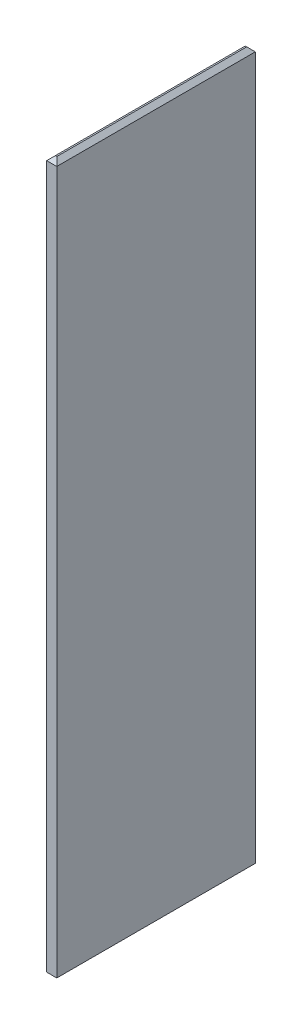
ISO-10303-21;
HEADER;
FILE_DESCRIPTION(('STEP AP214'),'2;1');
FILE_NAME('part.step','',(''),(''),'','','');
FILE_SCHEMA(('AUTOMOTIVE_DESIGN { 1 0 10303 214 1 1 1 1 }'));
ENDSEC;
DATA;
#1=APPLICATION_CONTEXT('core data for automotive mechanical design processes');
#2=APPLICATION_PROTOCOL_DEFINITION('international standard','automotive_design',2000,#1);
#3=PRODUCT_CONTEXT('',#1,'mechanical');
#4=PRODUCT('Part','Part','',(#3));
#5=PRODUCT_RELATED_PRODUCT_CATEGORY('part','',(#4));
#6=PRODUCT_DEFINITION_FORMATION('','',#4);
#7=PRODUCT_DEFINITION_CONTEXT('part definition',#1,'design');
#8=PRODUCT_DEFINITION('design','',#6,#7);
#9=PRODUCT_DEFINITION_SHAPE('','',#8);
#10=(LENGTH_UNIT() NAMED_UNIT(*) SI_UNIT(.MILLI.,.METRE.));
#11=(NAMED_UNIT(*) PLANE_ANGLE_UNIT() SI_UNIT($,.RADIAN.));
#12=(NAMED_UNIT(*) SI_UNIT($,.STERADIAN.) SOLID_ANGLE_UNIT());
#13=UNCERTAINTY_MEASURE_WITH_UNIT(LENGTH_MEASURE(1.E-05),#10,'distance_accuracy_value','');
#14=(GEOMETRIC_REPRESENTATION_CONTEXT(3) GLOBAL_UNCERTAINTY_ASSIGNED_CONTEXT((#13)) GLOBAL_UNIT_ASSIGNED_CONTEXT((#10,
#11,#12)) REPRESENTATION_CONTEXT('',''));
#15=CARTESIAN_POINT('',(0.,0.,0.));
#16=DIRECTION('',(0.,0.,1.));
#17=DIRECTION('',(1.,0.,0.));
#18=AXIS2_PLACEMENT_3D('',#15,#16,#17);
#19=CARTESIAN_POINT('',(-76.2000000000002,10749.8,1500.));
#20=DIRECTION('',(1.,0.,0.));
#21=DIRECTION('',(0.,0.,-1.));
#22=AXIS2_PLACEMENT_3D('',#19,#20,#21);
#23=PLANE('',#22);
#24=DIRECTION('',(0.,-1.,0.));
#25=VECTOR('',#24,1.);
#26=CARTESIAN_POINT('',(-76.2000000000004,10749.8,-1500.));
#27=LINE('',#26,#25);
#28=CARTESIAN_POINT('',(-76.2000000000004,10684.8,-1500.));
#29=VERTEX_POINT('',#28);
#30=CARTESIAN_POINT('',(-76.2000000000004,64.9999999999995,-1500.));
#31=VERTEX_POINT('',#30);
#32=EDGE_CURVE('E154',#29,#31,#27,.T.);
#33=ORIENTED_EDGE('',*,*,#32,.T.);
#34=DIRECTION('',(0.,0.,1.));
#35=VECTOR('',#34,1.);
#36=CARTESIAN_POINT('',(-76.2000000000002,64.9999999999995,1500.));
#37=LINE('',#36,#35);
#38=CARTESIAN_POINT('',(-76.2000000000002,64.9999999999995,1500.));
#39=VERTEX_POINT('',#38);
#40=EDGE_CURVE('E163',#31,#39,#37,.T.);
#41=ORIENTED_EDGE('',*,*,#40,.T.);
#42=DIRECTION('',(0.,-1.,0.));
#43=VECTOR('',#42,1.);
#44=CARTESIAN_POINT('',(-76.2000000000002,10749.8,1500.));
#45=LINE('',#44,#43);
#46=CARTESIAN_POINT('',(-76.2000000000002,10684.8,1500.));
#47=VERTEX_POINT('',#46);
#48=EDGE_CURVE('E134',#47,#39,#45,.T.);
#49=ORIENTED_EDGE('',*,*,#48,.F.);
#50=DIRECTION('',(0.,0.,-1.));
#51=VECTOR('',#50,1.);
#52=CARTESIAN_POINT('',(-76.2000000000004,10684.8,-1500.));
#53=LINE('',#52,#51);
#54=EDGE_CURVE('E167',#47,#29,#53,.T.);
#55=ORIENTED_EDGE('',*,*,#54,.T.);
#56=EDGE_LOOP('',(#33,#41,#49,#55));
#57=FACE_BOUND('',#56,.T.);
#58=ADVANCED_FACE('F44',(#57),#23,.F.);
#59=CARTESIAN_POINT('',(76.1999999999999,10749.8,1500.));
#60=DIRECTION('',(0.,0.,-1.));
#61=DIRECTION('',(-1.,0.,0.));
#62=AXIS2_PLACEMENT_3D('',#59,#60,#61);
#63=PLANE('',#62);
#64=ORIENTED_EDGE('',*,*,#48,.T.);
#65=DIRECTION('',(1.,0.,0.));
#66=VECTOR('',#65,1.);
#67=CARTESIAN_POINT('',(76.1999999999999,64.9999999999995,1500.));
#68=LINE('',#67,#66);
#69=CARTESIAN_POINT('',(76.1999999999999,64.9999999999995,1500.));
#70=VERTEX_POINT('',#69);
#71=EDGE_CURVE('E132',#39,#70,#68,.T.);
#72=ORIENTED_EDGE('',*,*,#71,.T.);
#73=DIRECTION('',(0.,-1.,0.));
#74=VECTOR('',#73,1.);
#75=CARTESIAN_POINT('',(76.1999999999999,10749.8,1500.));
#76=LINE('',#75,#74);
#77=CARTESIAN_POINT('',(76.1999999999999,10684.8,1500.));
#78=VERTEX_POINT('',#77);
#79=EDGE_CURVE('E113',#78,#70,#76,.T.);
#80=ORIENTED_EDGE('',*,*,#79,.F.);
#81=DIRECTION('',(-1.,0.,0.));
#82=VECTOR('',#81,1.);
#83=CARTESIAN_POINT('',(-76.2000000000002,10684.8,1500.));
#84=LINE('',#83,#82);
#85=EDGE_CURVE('E129',#78,#47,#84,.T.);
#86=ORIENTED_EDGE('',*,*,#85,.T.);
#87=EDGE_LOOP('',(#64,#72,#80,#86));
#88=FACE_BOUND('',#87,.T.);
#89=ADVANCED_FACE('F126',(#88),#63,.F.);
#90=CARTESIAN_POINT('',(76.1999999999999,10749.8,1500.));
#91=DIRECTION('',(-1.,0.,0.));
#92=DIRECTION('',(0.,0.,1.));
#93=AXIS2_PLACEMENT_3D('',#90,#91,#92);
#94=PLANE('',#93);
#95=ORIENTED_EDGE('',*,*,#79,.T.);
#96=DIRECTION('',(0.,0.,-1.));
#97=VECTOR('',#96,1.);
#98=CARTESIAN_POINT('',(76.1999999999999,64.9999999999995,1500.));
#99=LINE('',#98,#97);
#100=CARTESIAN_POINT('',(76.1999999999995,64.9999999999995,-1500.));
#101=VERTEX_POINT('',#100);
#102=EDGE_CURVE('E122',#70,#101,#99,.T.);
#103=ORIENTED_EDGE('',*,*,#102,.T.);
#104=DIRECTION('',(0.,-1.,0.));
#105=VECTOR('',#104,1.);
#106=CARTESIAN_POINT('',(76.1999999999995,10749.8,-1500.));
#107=LINE('',#106,#105);
#108=CARTESIAN_POINT('',(76.1999999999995,10684.8,-1500.));
#109=VERTEX_POINT('',#108);
#110=EDGE_CURVE('E117',#109,#101,#107,.T.);
#111=ORIENTED_EDGE('',*,*,#110,.F.);
#112=DIRECTION('',(0.,0.,1.));
#113=VECTOR('',#112,1.);
#114=CARTESIAN_POINT('',(76.1999999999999,10684.8,1500.));
#115=LINE('',#114,#113);
#116=EDGE_CURVE('E115',#109,#78,#115,.T.);
#117=ORIENTED_EDGE('',*,*,#116,.T.);
#118=EDGE_LOOP('',(#95,#103,#111,#117));
#119=FACE_BOUND('',#118,.T.);
#120=ADVANCED_FACE('F111',(#119),#94,.F.);
#121=CARTESIAN_POINT('',(76.1999999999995,10749.8,-1500.));
#122=DIRECTION('',(0.,0.,1.));
#123=DIRECTION('',(1.,0.,0.));
#124=AXIS2_PLACEMENT_3D('',#121,#122,#123);
#125=PLANE('',#124);
#126=ORIENTED_EDGE('',*,*,#110,.T.);
#127=DIRECTION('',(-1.,0.,0.));
#128=VECTOR('',#127,1.);
#129=CARTESIAN_POINT('',(76.1999999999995,64.9999999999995,-1500.));
#130=LINE('',#129,#128);
#131=EDGE_CURVE('E169',#101,#31,#130,.T.);
#132=ORIENTED_EDGE('',*,*,#131,.T.);
#133=ORIENTED_EDGE('',*,*,#32,.F.);
#134=DIRECTION('',(1.,0.,0.));
#135=VECTOR('',#134,1.);
#136=CARTESIAN_POINT('',(76.1999999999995,10684.8,-1500.));
#137=LINE('',#136,#135);
#138=EDGE_CURVE('E168',#29,#109,#137,.T.);
#139=ORIENTED_EDGE('',*,*,#138,.T.);
#140=EDGE_LOOP('',(#126,#132,#133,#139));
#141=FACE_BOUND('',#140,.T.);
#142=ADVANCED_FACE('F208',(#141),#125,.F.);
#143=CARTESIAN_POINT('',(0.,10749.8,0.));
#144=DIRECTION('',(0.,1.,0.));
#145=DIRECTION('',(0.,0.,1.));
#146=AXIS2_PLACEMENT_3D('',#143,#144,#145);
#147=PLANE('',#146);
#148=DIRECTION('',(0.,0.,-1.));
#149=VECTOR('',#148,1.);
#150=CARTESIAN_POINT('',(11.2,10749.8,-1500.));
#151=LINE('',#150,#149);
#152=CARTESIAN_POINT('',(11.2000000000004,10749.8,1435.));
#153=VERTEX_POINT('',#152);
#154=CARTESIAN_POINT('',(11.2,10749.8,-1435.));
#155=VERTEX_POINT('',#154);
#156=EDGE_CURVE('E54',#153,#155,#151,.T.);
#157=ORIENTED_EDGE('',*,*,#156,.T.);
#158=DIRECTION('',(-1.,0.,0.));
#159=VECTOR('',#158,1.);
#160=CARTESIAN_POINT('',(-76.2000000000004,10749.8,-1435.));
#161=LINE('',#160,#159);
#162=CARTESIAN_POINT('',(-11.2000000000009,10749.8,-1435.));
#163=VERTEX_POINT('',#162);
#164=EDGE_CURVE('E11',#155,#163,#161,.T.);
#165=ORIENTED_EDGE('',*,*,#164,.T.);
#166=DIRECTION('',(0.,0.,1.));
#167=VECTOR('',#166,1.);
#168=CARTESIAN_POINT('',(-11.2000000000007,10749.8,1500.));
#169=LINE('',#168,#167);
#170=CARTESIAN_POINT('',(-11.2000000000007,10749.8,1435.));
#171=VERTEX_POINT('',#170);
#172=EDGE_CURVE('E165',#163,#171,#169,.T.);
#173=ORIENTED_EDGE('',*,*,#172,.T.);
#174=DIRECTION('',(1.,0.,0.));
#175=VECTOR('',#174,1.);
#176=CARTESIAN_POINT('',(76.1999999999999,10749.8,1435.));
#177=LINE('',#176,#175);
#178=EDGE_CURVE('E67',#171,#153,#177,.T.);
#179=ORIENTED_EDGE('',*,*,#178,.T.);
#180=EDGE_LOOP('',(#157,#165,#173,#179));
#181=FACE_BOUND('',#180,.T.);
#182=ADVANCED_FACE('F212',(#181),#147,.T.);
#183=CARTESIAN_POINT('',(0.,0.,0.));
#184=DIRECTION('',(0.,1.,0.));
#185=DIRECTION('',(0.,0.,1.));
#186=AXIS2_PLACEMENT_3D('',#183,#184,#185);
#187=PLANE('',#186);
#188=DIRECTION('',(0.,0.,1.));
#189=VECTOR('',#188,1.);
#190=CARTESIAN_POINT('',(11.2000000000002,0.,0.));
#191=LINE('',#190,#189);
#192=CARTESIAN_POINT('',(11.2,0.,-1435.));
#193=VERTEX_POINT('',#192);
#194=CARTESIAN_POINT('',(11.2000000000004,0.,1435.));
#195=VERTEX_POINT('',#194);
#196=EDGE_CURVE('E175',#193,#195,#191,.T.);
#197=ORIENTED_EDGE('',*,*,#196,.T.);
#198=DIRECTION('',(-1.,0.,0.));
#199=VECTOR('',#198,1.);
#200=CARTESIAN_POINT('',(0.,0.,1435.));
#201=LINE('',#200,#199);
#202=CARTESIAN_POINT('',(-11.2000000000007,0.,1435.));
#203=VERTEX_POINT('',#202);
#204=EDGE_CURVE('E125',#195,#203,#201,.T.);
#205=ORIENTED_EDGE('',*,*,#204,.T.);
#206=DIRECTION('',(0.,0.,-1.));
#207=VECTOR('',#206,1.);
#208=CARTESIAN_POINT('',(-11.2000000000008,0.,0.));
#209=LINE('',#208,#207);
#210=CARTESIAN_POINT('',(-11.2000000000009,0.,-1435.));
#211=VERTEX_POINT('',#210);
#212=EDGE_CURVE('E179',#203,#211,#209,.T.);
#213=ORIENTED_EDGE('',*,*,#212,.T.);
#214=DIRECTION('',(1.,0.,0.));
#215=VECTOR('',#214,1.);
#216=CARTESIAN_POINT('',(0.,0.,-1435.));
#217=LINE('',#216,#215);
#218=EDGE_CURVE('E180',#211,#193,#217,.T.);
#219=ORIENTED_EDGE('',*,*,#218,.T.);
#220=EDGE_LOOP('',(#197,#205,#213,#219));
#221=FACE_BOUND('',#220,.T.);
#222=ADVANCED_FACE('F216',(#221),#187,.F.);
#223=CARTESIAN_POINT('',(76.1999999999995,64.9999999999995,-1500.));
#224=DIRECTION('',(0.,0.707106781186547,0.707106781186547));
#225=DIRECTION('',(-1.,0.,0.));
#226=AXIS2_PLACEMENT_3D('',#223,#224,#225);
#227=PLANE('',#226);
#228=DIRECTION('',(-0.577350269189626,-0.577350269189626,0.577350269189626));
#229=VECTOR('',#228,1.);
#230=CARTESIAN_POINT('',(76.1999999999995,64.9999999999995,-1500.));
#231=LINE('',#230,#229);
#232=EDGE_CURVE('E156',#193,#101,#231,.F.);
#233=ORIENTED_EDGE('',*,*,#232,.F.);
#234=ORIENTED_EDGE('',*,*,#218,.F.);
#235=DIRECTION('',(0.577350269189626,-0.577350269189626,0.577350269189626));
#236=VECTOR('',#235,1.);
#237=CARTESIAN_POINT('',(923.8,-935.,-499.999999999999));
#238=LINE('',#237,#236);
#239=EDGE_CURVE('E155',#31,#211,#238,.T.);
#240=ORIENTED_EDGE('',*,*,#239,.F.);
#241=ORIENTED_EDGE('',*,*,#131,.F.);
#242=EDGE_LOOP('',(#233,#234,#240,#241));
#243=FACE_BOUND('',#242,.T.);
#244=ADVANCED_FACE('F191',(#243),#227,.F.);
#245=CARTESIAN_POINT('',(-76.2000000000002,64.9999999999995,1500.));
#246=DIRECTION('',(0.707106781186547,0.707106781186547,0.));
#247=DIRECTION('',(0.,0.,1.));
#248=AXIS2_PLACEMENT_3D('',#245,#246,#247);
#249=PLANE('',#248);
#250=ORIENTED_EDGE('',*,*,#239,.T.);
#251=ORIENTED_EDGE('',*,*,#212,.F.);
#252=DIRECTION('',(-0.577350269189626,0.577350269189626,0.577350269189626));
#253=VECTOR('',#252,1.);
#254=CARTESIAN_POINT('',(-76.2000000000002,64.9999999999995,1500.));
#255=LINE('',#254,#253);
#256=EDGE_CURVE('E141',#39,#203,#255,.F.);
#257=ORIENTED_EDGE('',*,*,#256,.F.);
#258=ORIENTED_EDGE('',*,*,#40,.F.);
#259=EDGE_LOOP('',(#250,#251,#257,#258));
#260=FACE_BOUND('',#259,.T.);
#261=ADVANCED_FACE('F200',(#260),#249,.F.);
#262=CARTESIAN_POINT('',(76.1999999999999,64.9999999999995,1500.));
#263=DIRECTION('',(-0.707106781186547,0.707106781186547,0.));
#264=DIRECTION('',(0.,0.,-1.));
#265=AXIS2_PLACEMENT_3D('',#262,#263,#264);
#266=PLANE('',#265);
#267=ORIENTED_EDGE('',*,*,#232,.T.);
#268=ORIENTED_EDGE('',*,*,#102,.F.);
#269=DIRECTION('',(-0.577350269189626,-0.577350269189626,-0.577350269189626));
#270=VECTOR('',#269,1.);
#271=CARTESIAN_POINT('',(76.1999999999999,64.9999999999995,1500.));
#272=LINE('',#271,#270);
#273=EDGE_CURVE('E142',#195,#70,#272,.F.);
#274=ORIENTED_EDGE('',*,*,#273,.F.);
#275=ORIENTED_EDGE('',*,*,#196,.F.);
#276=EDGE_LOOP('',(#267,#268,#274,#275));
#277=FACE_BOUND('',#276,.T.);
#278=ADVANCED_FACE('F210',(#277),#266,.F.);
#279=CARTESIAN_POINT('',(76.1999999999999,64.9999999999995,1500.));
#280=DIRECTION('',(0.,0.707106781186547,-0.707106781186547));
#281=DIRECTION('',(1.,0.,0.));
#282=AXIS2_PLACEMENT_3D('',#279,#280,#281);
#283=PLANE('',#282);
#284=ORIENTED_EDGE('',*,*,#256,.T.);
#285=ORIENTED_EDGE('',*,*,#204,.F.);
#286=ORIENTED_EDGE('',*,*,#273,.T.);
#287=ORIENTED_EDGE('',*,*,#71,.F.);
#288=EDGE_LOOP('',(#284,#285,#286,#287));
#289=FACE_BOUND('',#288,.T.);
#290=ADVANCED_FACE('F205',(#289),#283,.F.);
#291=CARTESIAN_POINT('',(0.,10749.8,1435.));
#292=DIRECTION('',(0.,0.707106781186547,0.707106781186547));
#293=DIRECTION('',(-1.,0.,0.));
#294=AXIS2_PLACEMENT_3D('',#291,#292,#293);
#295=PLANE('',#294);
#296=DIRECTION('',(0.577350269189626,0.577350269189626,-0.577350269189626));
#297=VECTOR('',#296,1.);
#298=CARTESIAN_POINT('',(467.133333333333,11228.1333333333,956.666666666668));
#299=LINE('',#298,#297);
#300=EDGE_CURVE('E138',#47,#171,#299,.T.);
#301=ORIENTED_EDGE('',*,*,#300,.F.);
#302=ORIENTED_EDGE('',*,*,#85,.F.);
#303=DIRECTION('',(-0.577350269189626,0.577350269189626,-0.577350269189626));
#304=VECTOR('',#303,1.);
#305=CARTESIAN_POINT('',(7.46666666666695,10753.5333333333,1431.26666666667));
#306=LINE('',#305,#304);
#307=EDGE_CURVE('E49',#153,#78,#306,.F.);
#308=ORIENTED_EDGE('',*,*,#307,.F.);
#309=ORIENTED_EDGE('',*,*,#178,.F.);
#310=EDGE_LOOP('',(#301,#302,#308,#309));
#311=FACE_BOUND('',#310,.T.);
#312=ADVANCED_FACE('F48',(#311),#295,.T.);
#313=CARTESIAN_POINT('',(11.2000000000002,10749.8,0.));
#314=DIRECTION('',(0.707106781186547,0.707106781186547,0.));
#315=DIRECTION('',(0.,0.,1.));
#316=AXIS2_PLACEMENT_3D('',#313,#314,#315);
#317=PLANE('',#316);
#318=ORIENTED_EDGE('',*,*,#307,.T.);
#319=ORIENTED_EDGE('',*,*,#116,.F.);
#320=DIRECTION('',(-0.577350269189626,0.577350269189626,0.577350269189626));
#321=VECTOR('',#320,1.);
#322=CARTESIAN_POINT('',(-467.133333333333,11228.1333333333,-956.666666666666));
#323=LINE('',#322,#321);
#324=EDGE_CURVE('E144',#155,#109,#323,.F.);
#325=ORIENTED_EDGE('',*,*,#324,.F.);
#326=ORIENTED_EDGE('',*,*,#156,.F.);
#327=EDGE_LOOP('',(#318,#319,#325,#326));
#328=FACE_BOUND('',#327,.T.);
#329=ADVANCED_FACE('F143',(#328),#317,.T.);
#330=CARTESIAN_POINT('',(-11.2000000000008,10749.8,0.));
#331=DIRECTION('',(-0.707106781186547,0.707106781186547,0.));
#332=DIRECTION('',(0.,0.,-1.));
#333=AXIS2_PLACEMENT_3D('',#330,#331,#332);
#334=PLANE('',#333);
#335=ORIENTED_EDGE('',*,*,#300,.T.);
#336=ORIENTED_EDGE('',*,*,#172,.F.);
#337=DIRECTION('',(-0.577350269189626,-0.577350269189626,-0.577350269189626));
#338=VECTOR('',#337,1.);
#339=CARTESIAN_POINT('',(467.133333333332,11228.1333333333,-956.666666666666));
#340=LINE('',#339,#338);
#341=EDGE_CURVE('E146',#29,#163,#340,.F.);
#342=ORIENTED_EDGE('',*,*,#341,.F.);
#343=ORIENTED_EDGE('',*,*,#54,.F.);
#344=EDGE_LOOP('',(#335,#336,#342,#343));
#345=FACE_BOUND('',#344,.T.);
#346=ADVANCED_FACE('F213',(#345),#334,.T.);
#347=CARTESIAN_POINT('',(0.,10749.8,-1435.));
#348=DIRECTION('',(0.,0.707106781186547,-0.707106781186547));
#349=DIRECTION('',(1.,0.,0.));
#350=AXIS2_PLACEMENT_3D('',#347,#348,#349);
#351=PLANE('',#350);
#352=ORIENTED_EDGE('',*,*,#324,.T.);
#353=ORIENTED_EDGE('',*,*,#138,.F.);
#354=ORIENTED_EDGE('',*,*,#341,.T.);
#355=ORIENTED_EDGE('',*,*,#164,.F.);
#356=EDGE_LOOP('',(#352,#353,#354,#355));
#357=FACE_BOUND('',#356,.T.);
#358=ADVANCED_FACE('F211',(#357),#351,.T.);
#359=CLOSED_SHELL('',(#58,#89,#120,#142,#182,#222,#244,#261,#278,#290,#312,#329,#346,#358));
#360=MANIFOLD_SOLID_BREP('B2',#359);
#361=ADVANCED_BREP_SHAPE_REPRESENTATION('',(#18,#360),#14);
#362=SHAPE_DEFINITION_REPRESENTATION(#9,#361);
ENDSEC;
END-ISO-10303-21;
